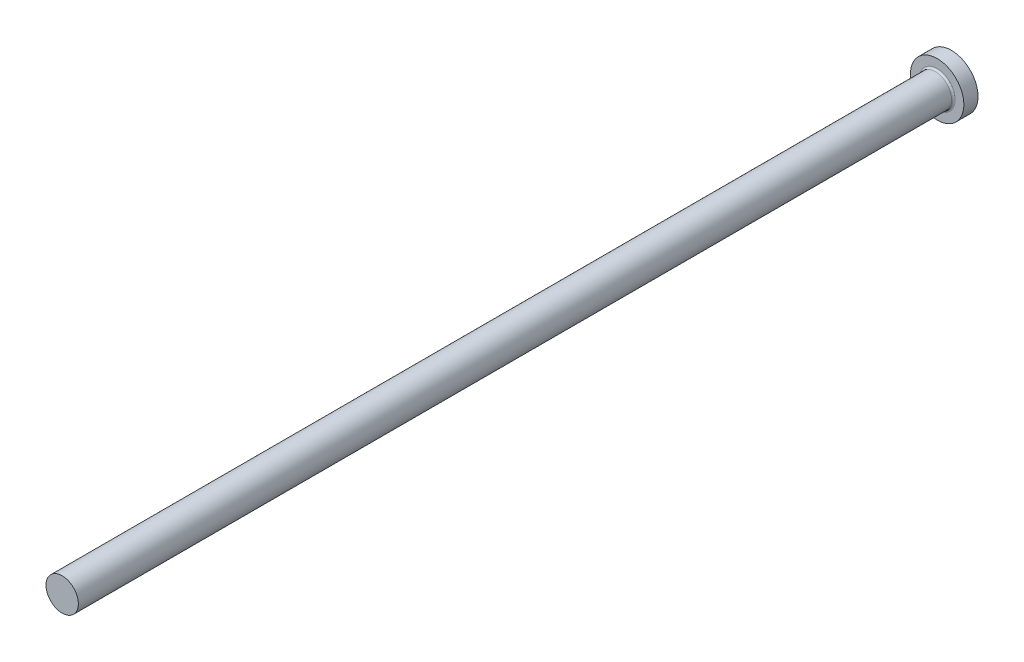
ISO-10303-21;
HEADER;
FILE_DESCRIPTION(('STEP AP214'),'2;1');
FILE_NAME('part.step','',(''),(''),'','','');
FILE_SCHEMA(('AUTOMOTIVE_DESIGN { 1 0 10303 214 1 1 1 1 }'));
ENDSEC;
DATA;
#1=APPLICATION_CONTEXT('core data for automotive mechanical design processes');
#2=APPLICATION_PROTOCOL_DEFINITION('international standard','automotive_design',2000,#1);
#3=PRODUCT_CONTEXT('',#1,'mechanical');
#4=PRODUCT('Part','Part','',(#3));
#5=PRODUCT_RELATED_PRODUCT_CATEGORY('part','',(#4));
#6=PRODUCT_DEFINITION_FORMATION('','',#4);
#7=PRODUCT_DEFINITION_CONTEXT('part definition',#1,'design');
#8=PRODUCT_DEFINITION('design','',#6,#7);
#9=PRODUCT_DEFINITION_SHAPE('','',#8);
#10=(LENGTH_UNIT() NAMED_UNIT(*) SI_UNIT(.MILLI.,.METRE.));
#11=(NAMED_UNIT(*) PLANE_ANGLE_UNIT() SI_UNIT($,.RADIAN.));
#12=(NAMED_UNIT(*) SI_UNIT($,.STERADIAN.) SOLID_ANGLE_UNIT());
#13=UNCERTAINTY_MEASURE_WITH_UNIT(LENGTH_MEASURE(1.E-05),#10,'distance_accuracy_value','');
#14=(GEOMETRIC_REPRESENTATION_CONTEXT(3) GLOBAL_UNCERTAINTY_ASSIGNED_CONTEXT((#13)) GLOBAL_UNIT_ASSIGNED_CONTEXT((#10,
#11,#12)) REPRESENTATION_CONTEXT('',''));
#15=CARTESIAN_POINT('',(0.,0.,0.));
#16=DIRECTION('',(0.,0.,1.));
#17=DIRECTION('',(1.,0.,0.));
#18=AXIS2_PLACEMENT_3D('',#15,#16,#17);
#19=CARTESIAN_POINT('',(7.5,0.,4.));
#20=DIRECTION('',(0.,0.,-1.));
#21=DIRECTION('',(-1.,0.,0.));
#22=AXIS2_PLACEMENT_3D('',#19,#20,#21);
#23=PLANE('',#22);
#24=CARTESIAN_POINT('',(0.,0.,4.));
#25=DIRECTION('',(0.,0.,-1.));
#26=DIRECTION('',(-1.,0.,0.));
#27=AXIS2_PLACEMENT_3D('',#24,#25,#26);
#28=CIRCLE('',#27,5.05000000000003);
#29=CARTESIAN_POINT('',(-5.05000000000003,0.,4.));
#30=VERTEX_POINT('',#29);
#31=EDGE_CURVE('E40',#30,#30,#28,.T.);
#32=ORIENTED_EDGE('',*,*,#31,.T.);
#33=EDGE_LOOP('',(#32));
#34=FACE_BOUND('',#33,.T.);
#35=CARTESIAN_POINT('',(0.,0.,4.));
#36=DIRECTION('',(0.,0.,-1.));
#37=DIRECTION('',(-1.,0.,0.));
#38=AXIS2_PLACEMENT_3D('',#35,#36,#37);
#39=CIRCLE('',#38,7.5);
#40=CARTESIAN_POINT('',(-7.5,0.,4.));
#41=VERTEX_POINT('',#40);
#42=EDGE_CURVE('E44',#41,#41,#39,.T.);
#43=ORIENTED_EDGE('',*,*,#42,.F.);
#44=EDGE_LOOP('',(#43));
#45=FACE_BOUND('',#44,.T.);
#46=ADVANCED_FACE('F33',(#34,#45),#23,.F.);
#47=CARTESIAN_POINT('',(0.,0.,-9.03322817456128));
#48=DIRECTION('',(0.,0.,-1.));
#49=DIRECTION('',(-1.,0.,0.));
#50=AXIS2_PLACEMENT_3D('',#47,#48,#49);
#51=CYLINDRICAL_SURFACE('',#50,7.5);
#52=CARTESIAN_POINT('',(0.,0.,0.));
#53=DIRECTION('',(0.,0.,-1.));
#54=DIRECTION('',(-1.,0.,0.));
#55=AXIS2_PLACEMENT_3D('',#52,#53,#54);
#56=CIRCLE('',#55,7.5);
#57=CARTESIAN_POINT('',(-7.5,0.,0.));
#58=VERTEX_POINT('',#57);
#59=EDGE_CURVE('E48',#58,#58,#56,.T.);
#60=ORIENTED_EDGE('',*,*,#59,.F.);
#61=EDGE_LOOP('',(#60));
#62=FACE_BOUND('',#61,.T.);
#63=ORIENTED_EDGE('',*,*,#42,.T.);
#64=EDGE_LOOP('',(#63));
#65=FACE_BOUND('',#64,.T.);
#66=ADVANCED_FACE('F68',(#62,#65),#51,.T.);
#67=CARTESIAN_POINT('',(0.,0.,0.));
#68=DIRECTION('',(0.,0.,1.));
#69=DIRECTION('',(1.,0.,0.));
#70=AXIS2_PLACEMENT_3D('',#67,#68,#69);
#71=PLANE('',#70);
#72=ORIENTED_EDGE('',*,*,#59,.T.);
#73=EDGE_LOOP('',(#72));
#74=FACE_BOUND('',#73,.T.);
#75=ADVANCED_FACE('F61',(#74),#71,.F.);
#76=CARTESIAN_POINT('',(0.,0.,250.));
#77=DIRECTION('',(0.,0.,-1.));
#78=DIRECTION('',(-1.,0.,0.));
#79=AXIS2_PLACEMENT_3D('',#76,#77,#78);
#80=PLANE('',#79);
#81=CARTESIAN_POINT('',(0.,0.,250.));
#82=DIRECTION('',(0.,0.,-1.));
#83=DIRECTION('',(-1.,0.,0.));
#84=AXIS2_PLACEMENT_3D('',#81,#82,#83);
#85=CIRCLE('',#84,4.55000000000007);
#86=CARTESIAN_POINT('',(-4.55000000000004,0.,250.));
#87=VERTEX_POINT('',#86);
#88=EDGE_CURVE('E53',#87,#87,#85,.T.);
#89=ORIENTED_EDGE('',*,*,#88,.F.);
#90=EDGE_LOOP('',(#89));
#91=FACE_BOUND('',#90,.T.);
#92=ADVANCED_FACE('F59',(#91),#80,.F.);
#93=CARTESIAN_POINT('',(0.,0.,-9.03322817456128));
#94=DIRECTION('',(0.,0.,-1.));
#95=DIRECTION('',(-1.,0.,0.));
#96=AXIS2_PLACEMENT_3D('',#93,#94,#95);
#97=CYLINDRICAL_SURFACE('',#96,4.55000000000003);
#98=CARTESIAN_POINT('',(0.,0.,4.5));
#99=DIRECTION('',(0.,0.,-1.));
#100=DIRECTION('',(-1.,0.,0.));
#101=AXIS2_PLACEMENT_3D('',#98,#99,#100);
#102=CIRCLE('',#101,4.55000000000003);
#103=CARTESIAN_POINT('',(-4.55000000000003,0.,4.5));
#104=VERTEX_POINT('',#103);
#105=EDGE_CURVE('E10',#104,#104,#102,.F.);
#106=ORIENTED_EDGE('',*,*,#105,.T.);
#107=EDGE_LOOP('',(#106));
#108=FACE_BOUND('',#107,.T.);
#109=ORIENTED_EDGE('',*,*,#88,.T.);
#110=EDGE_LOOP('',(#109));
#111=FACE_BOUND('',#110,.T.);
#112=ADVANCED_FACE('F57',(#108,#111),#97,.T.);
#113=CARTESIAN_POINT('',(0.,0.,4.5));
#114=DIRECTION('',(0.,0.,-1.));
#115=DIRECTION('',(-1.,0.,0.));
#116=AXIS2_PLACEMENT_3D('',#113,#114,#115);
#117=TOROIDAL_SURFACE('',#116,5.05000000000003,0.5);
#118=ORIENTED_EDGE('',*,*,#105,.F.);
#119=EDGE_LOOP('',(#118));
#120=FACE_BOUND('',#119,.T.);
#121=ORIENTED_EDGE('',*,*,#31,.F.);
#122=EDGE_LOOP('',(#121));
#123=FACE_BOUND('',#122,.T.);
#124=ADVANCED_FACE('F35',(#120,#123),#117,.F.);
#125=CLOSED_SHELL('',(#46,#66,#75,#92,#112,#124));
#126=MANIFOLD_SOLID_BREP('B2',#125);
#127=ADVANCED_BREP_SHAPE_REPRESENTATION('',(#18,#126),#14);
#128=SHAPE_DEFINITION_REPRESENTATION(#9,#127);
ENDSEC;
END-ISO-10303-21;
